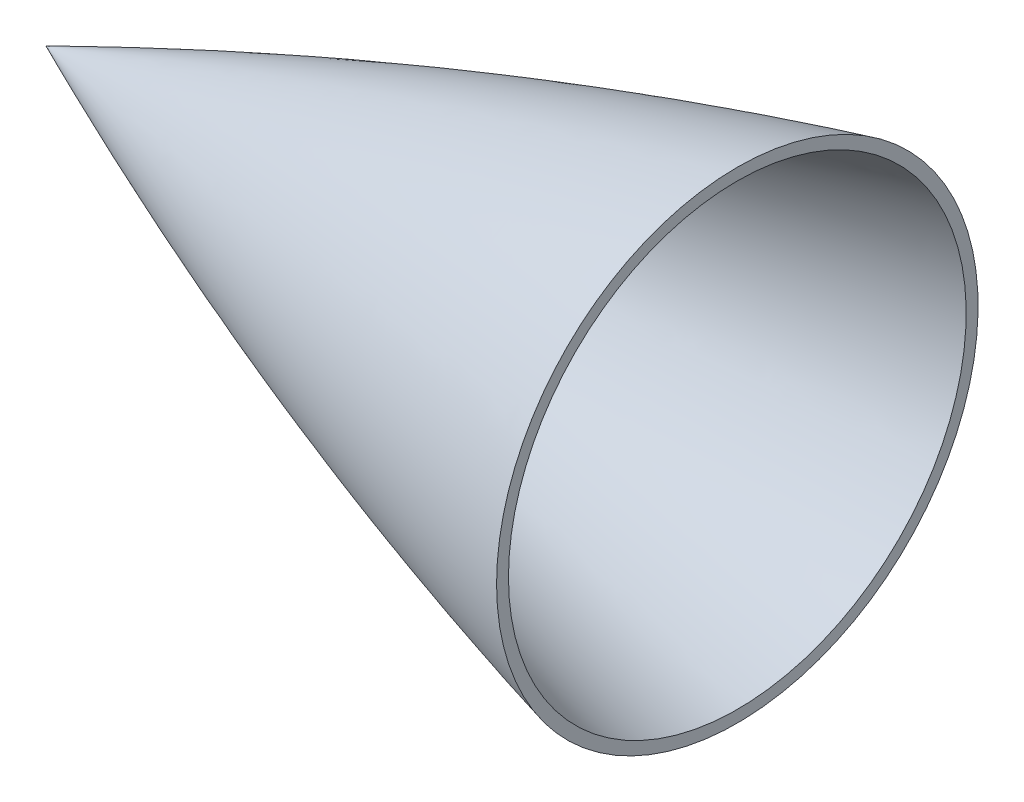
ISO-10303-21;
HEADER;
FILE_DESCRIPTION(('STEP AP214'),'2;1');
FILE_NAME('part.step','',(''),(''),'','','');
FILE_SCHEMA(('AUTOMOTIVE_DESIGN { 1 0 10303 214 1 1 1 1 }'));
ENDSEC;
DATA;
#1=APPLICATION_CONTEXT('core data for automotive mechanical design processes');
#2=APPLICATION_PROTOCOL_DEFINITION('international standard','automotive_design',2000,#1);
#3=PRODUCT_CONTEXT('',#1,'mechanical');
#4=PRODUCT('Part','Part','',(#3));
#5=PRODUCT_RELATED_PRODUCT_CATEGORY('part','',(#4));
#6=PRODUCT_DEFINITION_FORMATION('','',#4);
#7=PRODUCT_DEFINITION_CONTEXT('part definition',#1,'design');
#8=PRODUCT_DEFINITION('design','',#6,#7);
#9=PRODUCT_DEFINITION_SHAPE('','',#8);
#10=(LENGTH_UNIT() NAMED_UNIT(*) SI_UNIT(.MILLI.,.METRE.));
#11=(NAMED_UNIT(*) PLANE_ANGLE_UNIT() SI_UNIT($,.RADIAN.));
#12=(NAMED_UNIT(*) SI_UNIT($,.STERADIAN.) SOLID_ANGLE_UNIT());
#13=UNCERTAINTY_MEASURE_WITH_UNIT(LENGTH_MEASURE(1.E-05),#10,'distance_accuracy_value','');
#14=(GEOMETRIC_REPRESENTATION_CONTEXT(3) GLOBAL_UNCERTAINTY_ASSIGNED_CONTEXT((#13)) GLOBAL_UNIT_ASSIGNED_CONTEXT((#10,
#11,#12)) REPRESENTATION_CONTEXT('',''));
#15=CARTESIAN_POINT('',(0.,0.,0.));
#16=DIRECTION('',(0.,0.,1.));
#17=DIRECTION('',(1.,0.,0.));
#18=AXIS2_PLACEMENT_3D('',#15,#16,#17);
#19=CARTESIAN_POINT('',(1850.39,405.13,0.));
#20=CARTESIAN_POINT('',(1209.47050744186,405.13,0.));
#21=CARTESIAN_POINT('',(585.273449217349,258.505072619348,0.));
#22=CARTESIAN_POINT('',(0.,0.,0.));
#23=B_SPLINE_CURVE_WITH_KNOTS('',3,(#19,#20,#21,#22),.UNSPECIFIED.,.F.,.F.,(4,4),(0.,1.),.UNSPECIFIED.);
#24=CARTESIAN_POINT('',(0.,0.,0.));
#25=DIRECTION('',(-1.,0.,0.));
#26=AXIS1_PLACEMENT('',#24,#25);
#27=SURFACE_OF_REVOLUTION('',#23,#26);
#28=CARTESIAN_POINT('',(0.,0.,0.));
#29=VERTEX_POINT('',#28);
#30=VERTEX_LOOP('',#29);
#31=FACE_BOUND('',#30,.T.);
#32=CARTESIAN_POINT('',(761.999999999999,0.,0.));
#33=DIRECTION('',(-1.,0.,0.));
#34=DIRECTION('',(0.,0.,1.));
#35=AXIS2_PLACEMENT_3D('',#32,#33,#34);
#36=CIRCLE('',#35,265.376558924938);
#37=CARTESIAN_POINT('',(761.999999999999,0.,265.376558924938));
#38=VERTEX_POINT('',#37);
#39=EDGE_CURVE('E11',#38,#38,#36,.T.);
#40=ORIENTED_EDGE('',*,*,#39,.T.);
#41=EDGE_LOOP('',(#40));
#42=FACE_BOUND('',#41,.T.);
#43=ADVANCED_FACE('F33',(#31,#42),#27,.T.);
#44=CARTESIAN_POINT('',(761.999999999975,265.376558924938,0.));
#45=DIRECTION('',(-1.,0.,0.));
#46=DIRECTION('',(0.,0.,1.));
#47=AXIS2_PLACEMENT_3D('',#44,#45,#46);
#48=PLANE('',#47);
#49=ORIENTED_EDGE('',*,*,#39,.F.);
#50=EDGE_LOOP('',(#49));
#51=FACE_BOUND('',#50,.T.);
#52=CARTESIAN_POINT('',(761.999999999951,0.,0.));
#53=DIRECTION('',(-1.,0.,0.));
#54=DIRECTION('',(0.,0.,1.));
#55=AXIS2_PLACEMENT_3D('',#52,#53,#54);
#56=CIRCLE('',#55,252.263848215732);
#57=CARTESIAN_POINT('',(761.999999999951,0.,252.263848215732));
#58=VERTEX_POINT('',#57);
#59=EDGE_CURVE('E41',#58,#58,#56,.T.);
#60=ORIENTED_EDGE('',*,*,#59,.T.);
#61=EDGE_LOOP('',(#60));
#62=FACE_BOUND('',#61,.T.);
#63=ADVANCED_FACE('F49',(#51,#62),#48,.F.);
#64=CARTESIAN_POINT('',(31.6335068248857,0.,0.));
#65=CARTESIAN_POINT('',(319.71551999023,125.321167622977,0.));
#66=CARTESIAN_POINT('',(617.080971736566,223.42872115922,0.));
#67=CARTESIAN_POINT('',(1225.08758104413,356.982401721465,0.));
#68=CARTESIAN_POINT('',(1535.72811605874,392.43,0.));
#69=CARTESIAN_POINT('',(1850.39,392.43,0.));
#70=B_SPLINE_CURVE_WITH_KNOTS('',3,(#64,#65,#66,#67,#68,#69),.UNSPECIFIED.,.F.,.F.,(4,2,4),(0.,
0.5,1.),.UNSPECIFIED.);
#71=CARTESIAN_POINT('',(0.,0.,0.));
#72=DIRECTION('',(-1.,0.,0.));
#73=AXIS1_PLACEMENT('',#71,#72);
#74=SURFACE_OF_REVOLUTION('',#70,#73);
#75=ORIENTED_EDGE('',*,*,#59,.F.);
#76=EDGE_LOOP('',(#75));
#77=FACE_BOUND('',#76,.T.);
#78=CARTESIAN_POINT('',(31.6335068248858,0.,0.));
#79=VERTEX_POINT('',#78);
#80=VERTEX_LOOP('',#79);
#81=FACE_BOUND('',#80,.T.);
#82=ADVANCED_FACE('F54',(#77,#81),#74,.T.);
#83=CLOSED_SHELL('',(#43,#63,#82));
#84=MANIFOLD_SOLID_BREP('B2',#83);
#85=ADVANCED_BREP_SHAPE_REPRESENTATION('',(#18,#84),#14);
#86=SHAPE_DEFINITION_REPRESENTATION(#9,#85);
ENDSEC;
END-ISO-10303-21;
